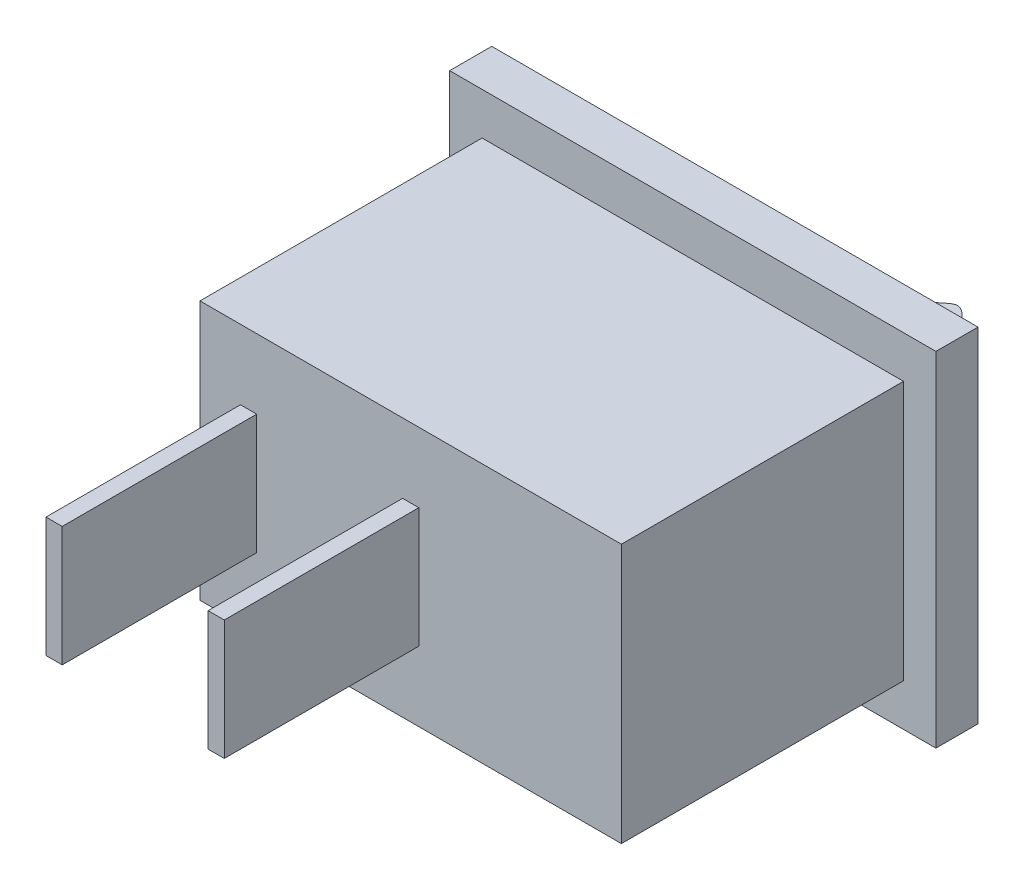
ISO-10303-21;
HEADER;
FILE_DESCRIPTION(('STEP AP214'),'2;1');
FILE_NAME('part.step','',(''),(''),'','','');
FILE_SCHEMA(('AUTOMOTIVE_DESIGN { 1 0 10303 214 1 1 1 1 }'));
ENDSEC;
DATA;
#1=APPLICATION_CONTEXT('core data for automotive mechanical design processes');
#2=APPLICATION_PROTOCOL_DEFINITION('international standard','automotive_design',2000,#1);
#3=PRODUCT_CONTEXT('',#1,'mechanical');
#4=PRODUCT('Part','Part','',(#3));
#5=PRODUCT_RELATED_PRODUCT_CATEGORY('part','',(#4));
#6=PRODUCT_DEFINITION_FORMATION('','',#4);
#7=PRODUCT_DEFINITION_CONTEXT('part definition',#1,'design');
#8=PRODUCT_DEFINITION('design','',#6,#7);
#9=PRODUCT_DEFINITION_SHAPE('','',#8);
#10=(LENGTH_UNIT() NAMED_UNIT(*) SI_UNIT(.MILLI.,.METRE.));
#11=(NAMED_UNIT(*) PLANE_ANGLE_UNIT() SI_UNIT($,.RADIAN.));
#12=(NAMED_UNIT(*) SI_UNIT($,.STERADIAN.) SOLID_ANGLE_UNIT());
#13=UNCERTAINTY_MEASURE_WITH_UNIT(LENGTH_MEASURE(1.E-05),#10,'distance_accuracy_value','');
#14=(GEOMETRIC_REPRESENTATION_CONTEXT(3) GLOBAL_UNCERTAINTY_ASSIGNED_CONTEXT((#13)) GLOBAL_UNIT_ASSIGNED_CONTEXT((#10,
#11,#12)) REPRESENTATION_CONTEXT('',''));
#15=CARTESIAN_POINT('',(0.,0.,0.));
#16=DIRECTION('',(0.,0.,1.));
#17=DIRECTION('',(1.,0.,0.));
#18=AXIS2_PLACEMENT_3D('',#15,#16,#17);
#19=CARTESIAN_POINT('',(-7.5,5.3,-8.));
#20=DIRECTION('',(1.,0.,0.));
#21=DIRECTION('',(0.,0.,-1.));
#22=AXIS2_PLACEMENT_3D('',#19,#20,#21);
#23=PLANE('',#22);
#24=DIRECTION('',(0.,-1.,0.));
#25=VECTOR('',#24,1.);
#26=CARTESIAN_POINT('',(-7.5,-4.,-6.70193985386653));
#27=LINE('',#26,#25);
#28=CARTESIAN_POINT('',(-7.5,5.3,-6.70193985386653));
#29=VERTEX_POINT('',#28);
#30=CARTESIAN_POINT('',(-7.5,-5.3,-6.70193985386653));
#31=VERTEX_POINT('',#30);
#32=EDGE_CURVE('E205',#29,#31,#27,.T.);
#33=ORIENTED_EDGE('',*,*,#32,.F.);
#34=DIRECTION('',(0.,0.,1.));
#35=VECTOR('',#34,1.);
#36=CARTESIAN_POINT('',(-7.5,5.3,-8.));
#37=LINE('',#36,#35);
#38=CARTESIAN_POINT('',(-7.5,5.3,-8.));
#39=VERTEX_POINT('',#38);
#40=EDGE_CURVE('E265',#39,#29,#37,.T.);
#41=ORIENTED_EDGE('',*,*,#40,.F.);
#42=DIRECTION('',(0.,-1.,0.));
#43=VECTOR('',#42,1.);
#44=CARTESIAN_POINT('',(-7.5,5.3,-8.));
#45=LINE('',#44,#43);
#46=CARTESIAN_POINT('',(-7.5,-5.3,-8.));
#47=VERTEX_POINT('',#46);
#48=EDGE_CURVE('E273',#39,#47,#45,.T.);
#49=ORIENTED_EDGE('',*,*,#48,.T.);
#50=DIRECTION('',(0.,0.,1.));
#51=VECTOR('',#50,1.);
#52=CARTESIAN_POINT('',(-7.5,-5.3,-8.));
#53=LINE('',#52,#51);
#54=EDGE_CURVE('E264',#47,#31,#53,.T.);
#55=ORIENTED_EDGE('',*,*,#54,.T.);
#56=EDGE_LOOP('',(#33,#41,#49,#55));
#57=FACE_BOUND('',#56,.T.);
#58=ADVANCED_FACE('F32',(#57),#23,.F.);
#59=CARTESIAN_POINT('',(-5.25,5.3,8.));
#60=DIRECTION('',(1.,0.,0.));
#61=DIRECTION('',(0.,0.,-1.));
#62=AXIS2_PLACEMENT_3D('',#59,#60,#61);
#63=PLANE('',#62);
#64=DIRECTION('',(0.,-1.,0.));
#65=VECTOR('',#64,1.);
#66=CARTESIAN_POINT('',(-5.25,5.3,2.));
#67=LINE('',#66,#65);
#68=CARTESIAN_POINT('',(-5.25,1.85,2.));
#69=VERTEX_POINT('',#68);
#70=CARTESIAN_POINT('',(-5.25,-1.85,2.));
#71=VERTEX_POINT('',#70);
#72=EDGE_CURVE('E305',#69,#71,#67,.T.);
#73=ORIENTED_EDGE('',*,*,#72,.T.);
#74=DIRECTION('',(0.,0.,1.));
#75=VECTOR('',#74,1.);
#76=CARTESIAN_POINT('',(-5.25,-1.85,8.));
#77=LINE('',#76,#75);
#78=CARTESIAN_POINT('',(-5.25,-1.85,8.));
#79=VERTEX_POINT('',#78);
#80=EDGE_CURVE('E261',#71,#79,#77,.T.);
#81=ORIENTED_EDGE('',*,*,#80,.T.);
#82=DIRECTION('',(0.,-1.,0.));
#83=VECTOR('',#82,1.);
#84=CARTESIAN_POINT('',(-5.25,5.3,8.));
#85=LINE('',#84,#83);
#86=CARTESIAN_POINT('',(-5.25,1.85,8.));
#87=VERTEX_POINT('',#86);
#88=EDGE_CURVE('E302',#87,#79,#85,.T.);
#89=ORIENTED_EDGE('',*,*,#88,.F.);
#90=DIRECTION('',(0.,0.,-1.));
#91=VECTOR('',#90,1.);
#92=CARTESIAN_POINT('',(-5.25,1.85,8.));
#93=LINE('',#92,#91);
#94=EDGE_CURVE('E243',#87,#69,#93,.T.);
#95=ORIENTED_EDGE('',*,*,#94,.T.);
#96=EDGE_LOOP('',(#73,#81,#89,#95));
#97=FACE_BOUND('',#96,.T.);
#98=ADVANCED_FACE('F339',(#97),#63,.F.);
#99=CARTESIAN_POINT('',(-5.25,5.3,8.));
#100=DIRECTION('',(0.,0.,-1.));
#101=DIRECTION('',(-1.,0.,0.));
#102=AXIS2_PLACEMENT_3D('',#99,#100,#101);
#103=PLANE('',#102);
#104=ORIENTED_EDGE('',*,*,#88,.T.);
#105=DIRECTION('',(1.,0.,0.));
#106=VECTOR('',#105,1.);
#107=CARTESIAN_POINT('',(-5.25,-1.85,8.));
#108=LINE('',#107,#106);
#109=CARTESIAN_POINT('',(-4.75,-1.85,8.));
#110=VERTEX_POINT('',#109);
#111=EDGE_CURVE('E258',#79,#110,#108,.T.);
#112=ORIENTED_EDGE('',*,*,#111,.T.);
#113=DIRECTION('',(0.,-1.,0.));
#114=VECTOR('',#113,1.);
#115=CARTESIAN_POINT('',(-4.75,5.3,8.));
#116=LINE('',#115,#114);
#117=CARTESIAN_POINT('',(-4.75,1.85,8.));
#118=VERTEX_POINT('',#117);
#119=EDGE_CURVE('E299',#118,#110,#116,.T.);
#120=ORIENTED_EDGE('',*,*,#119,.F.);
#121=DIRECTION('',(-1.,0.,0.));
#122=VECTOR('',#121,1.);
#123=CARTESIAN_POINT('',(-5.25,1.85,8.));
#124=LINE('',#123,#122);
#125=EDGE_CURVE('E240',#118,#87,#124,.T.);
#126=ORIENTED_EDGE('',*,*,#125,.T.);
#127=EDGE_LOOP('',(#104,#112,#120,#126));
#128=FACE_BOUND('',#127,.T.);
#129=ADVANCED_FACE('F343',(#128),#103,.F.);
#130=CARTESIAN_POINT('',(-4.75,5.3,8.));
#131=DIRECTION('',(-1.,0.,0.));
#132=DIRECTION('',(0.,0.,1.));
#133=AXIS2_PLACEMENT_3D('',#130,#131,#132);
#134=PLANE('',#133);
#135=ORIENTED_EDGE('',*,*,#119,.T.);
#136=DIRECTION('',(0.,0.,-1.));
#137=VECTOR('',#136,1.);
#138=CARTESIAN_POINT('',(-4.75,-1.85,8.));
#139=LINE('',#138,#137);
#140=CARTESIAN_POINT('',(-4.75,-1.85,2.));
#141=VERTEX_POINT('',#140);
#142=EDGE_CURVE('E255',#110,#141,#139,.T.);
#143=ORIENTED_EDGE('',*,*,#142,.T.);
#144=DIRECTION('',(0.,-1.,0.));
#145=VECTOR('',#144,1.);
#146=CARTESIAN_POINT('',(-4.75,5.3,2.));
#147=LINE('',#146,#145);
#148=CARTESIAN_POINT('',(-4.75,1.85,2.));
#149=VERTEX_POINT('',#148);
#150=EDGE_CURVE('E296',#149,#141,#147,.T.);
#151=ORIENTED_EDGE('',*,*,#150,.F.);
#152=DIRECTION('',(0.,0.,1.));
#153=VECTOR('',#152,1.);
#154=CARTESIAN_POINT('',(-4.75,1.85,8.));
#155=LINE('',#154,#153);
#156=EDGE_CURVE('E237',#149,#118,#155,.T.);
#157=ORIENTED_EDGE('',*,*,#156,.T.);
#158=EDGE_LOOP('',(#135,#143,#151,#157));
#159=FACE_BOUND('',#158,.T.);
#160=ADVANCED_FACE('F348',(#159),#134,.F.);
#161=CARTESIAN_POINT('',(-0.25,5.3,8.));
#162=DIRECTION('',(1.,0.,0.));
#163=DIRECTION('',(0.,0.,-1.));
#164=AXIS2_PLACEMENT_3D('',#161,#162,#163);
#165=PLANE('',#164);
#166=DIRECTION('',(0.,-1.,0.));
#167=VECTOR('',#166,1.);
#168=CARTESIAN_POINT('',(-0.25,5.3,2.));
#169=LINE('',#168,#167);
#170=CARTESIAN_POINT('',(-0.25,1.85,2.));
#171=VERTEX_POINT('',#170);
#172=CARTESIAN_POINT('',(-0.25,-1.85,2.));
#173=VERTEX_POINT('',#172);
#174=EDGE_CURVE('E293',#171,#173,#169,.T.);
#175=ORIENTED_EDGE('',*,*,#174,.T.);
#176=DIRECTION('',(0.,0.,1.));
#177=VECTOR('',#176,1.);
#178=CARTESIAN_POINT('',(-0.25,-1.85,8.));
#179=LINE('',#178,#177);
#180=CARTESIAN_POINT('',(-0.25,-1.85,8.));
#181=VERTEX_POINT('',#180);
#182=EDGE_CURVE('E252',#173,#181,#179,.T.);
#183=ORIENTED_EDGE('',*,*,#182,.T.);
#184=DIRECTION('',(0.,-1.,0.));
#185=VECTOR('',#184,1.);
#186=CARTESIAN_POINT('',(-0.25,5.3,8.));
#187=LINE('',#186,#185);
#188=CARTESIAN_POINT('',(-0.25,1.85,8.));
#189=VERTEX_POINT('',#188);
#190=EDGE_CURVE('E290',#189,#181,#187,.T.);
#191=ORIENTED_EDGE('',*,*,#190,.F.);
#192=DIRECTION('',(0.,0.,-1.));
#193=VECTOR('',#192,1.);
#194=CARTESIAN_POINT('',(-0.25,1.85,8.));
#195=LINE('',#194,#193);
#196=EDGE_CURVE('E234',#189,#171,#195,.T.);
#197=ORIENTED_EDGE('',*,*,#196,.T.);
#198=EDGE_LOOP('',(#175,#183,#191,#197));
#199=FACE_BOUND('',#198,.T.);
#200=ADVANCED_FACE('F354',(#199),#165,.F.);
#201=CARTESIAN_POINT('',(-0.25,5.3,8.));
#202=DIRECTION('',(0.,0.,-1.));
#203=DIRECTION('',(-1.,0.,0.));
#204=AXIS2_PLACEMENT_3D('',#201,#202,#203);
#205=PLANE('',#204);
#206=ORIENTED_EDGE('',*,*,#190,.T.);
#207=DIRECTION('',(1.,0.,0.));
#208=VECTOR('',#207,1.);
#209=CARTESIAN_POINT('',(-0.25,-1.85,8.));
#210=LINE('',#209,#208);
#211=CARTESIAN_POINT('',(0.25,-1.85,8.));
#212=VERTEX_POINT('',#211);
#213=EDGE_CURVE('E249',#181,#212,#210,.T.);
#214=ORIENTED_EDGE('',*,*,#213,.T.);
#215=DIRECTION('',(0.,-1.,0.));
#216=VECTOR('',#215,1.);
#217=CARTESIAN_POINT('',(0.25,5.3,8.));
#218=LINE('',#217,#216);
#219=CARTESIAN_POINT('',(0.25,1.85,8.));
#220=VERTEX_POINT('',#219);
#221=EDGE_CURVE('E287',#220,#212,#218,.T.);
#222=ORIENTED_EDGE('',*,*,#221,.F.);
#223=DIRECTION('',(-1.,0.,0.));
#224=VECTOR('',#223,1.);
#225=CARTESIAN_POINT('',(-0.25,1.85,8.));
#226=LINE('',#225,#224);
#227=EDGE_CURVE('E231',#220,#189,#226,.T.);
#228=ORIENTED_EDGE('',*,*,#227,.T.);
#229=EDGE_LOOP('',(#206,#214,#222,#228));
#230=FACE_BOUND('',#229,.T.);
#231=ADVANCED_FACE('F358',(#230),#205,.F.);
#232=CARTESIAN_POINT('',(0.25,5.3,8.));
#233=DIRECTION('',(-1.,0.,0.));
#234=DIRECTION('',(0.,0.,1.));
#235=AXIS2_PLACEMENT_3D('',#232,#233,#234);
#236=PLANE('',#235);
#237=ORIENTED_EDGE('',*,*,#221,.T.);
#238=DIRECTION('',(0.,0.,-1.));
#239=VECTOR('',#238,1.);
#240=CARTESIAN_POINT('',(0.25,-1.85,8.));
#241=LINE('',#240,#239);
#242=CARTESIAN_POINT('',(0.25,-1.85,2.));
#243=VERTEX_POINT('',#242);
#244=EDGE_CURVE('E246',#212,#243,#241,.T.);
#245=ORIENTED_EDGE('',*,*,#244,.T.);
#246=DIRECTION('',(0.,-1.,0.));
#247=VECTOR('',#246,1.);
#248=CARTESIAN_POINT('',(0.25,5.3,2.));
#249=LINE('',#248,#247);
#250=CARTESIAN_POINT('',(0.25,1.85,2.));
#251=VERTEX_POINT('',#250);
#252=EDGE_CURVE('E284',#251,#243,#249,.T.);
#253=ORIENTED_EDGE('',*,*,#252,.F.);
#254=DIRECTION('',(0.,0.,1.));
#255=VECTOR('',#254,1.);
#256=CARTESIAN_POINT('',(0.25,1.85,8.));
#257=LINE('',#256,#255);
#258=EDGE_CURVE('E228',#251,#220,#257,.T.);
#259=ORIENTED_EDGE('',*,*,#258,.T.);
#260=EDGE_LOOP('',(#237,#245,#253,#259));
#261=FACE_BOUND('',#260,.T.);
#262=ADVANCED_FACE('F362',(#261),#236,.F.);
#263=CARTESIAN_POINT('',(0.25,5.3,2.));
#264=DIRECTION('',(0.,0.,-1.));
#265=DIRECTION('',(-1.,0.,0.));
#266=AXIS2_PLACEMENT_3D('',#263,#264,#265);
#267=PLANE('',#266);
#268=DIRECTION('',(-1.,0.,0.));
#269=VECTOR('',#268,1.);
#270=CARTESIAN_POINT('',(3.1,-1.85,2.));
#271=LINE('',#270,#269);
#272=EDGE_CURVE('E222',#141,#71,#271,.T.);
#273=ORIENTED_EDGE('',*,*,#272,.T.);
#274=ORIENTED_EDGE('',*,*,#72,.F.);
#275=DIRECTION('',(-1.,0.,0.));
#276=VECTOR('',#275,1.);
#277=CARTESIAN_POINT('',(3.1,1.85,2.));
#278=LINE('',#277,#276);
#279=EDGE_CURVE('E221',#149,#69,#278,.T.);
#280=ORIENTED_EDGE('',*,*,#279,.F.);
#281=ORIENTED_EDGE('',*,*,#150,.T.);
#282=EDGE_LOOP('',(#273,#274,#280,#281));
#283=FACE_BOUND('',#282,.T.);
#284=EDGE_CURVE('E225',#243,#173,#271,.T.);
#285=ORIENTED_EDGE('',*,*,#284,.T.);
#286=ORIENTED_EDGE('',*,*,#174,.F.);
#287=EDGE_CURVE('E226',#251,#171,#278,.T.);
#288=ORIENTED_EDGE('',*,*,#287,.F.);
#289=ORIENTED_EDGE('',*,*,#252,.T.);
#290=EDGE_LOOP('',(#285,#286,#288,#289));
#291=FACE_BOUND('',#290,.T.);
#292=DIRECTION('',(1.,0.,0.));
#293=VECTOR('',#292,1.);
#294=CARTESIAN_POINT('',(0.25,-4.,2.));
#295=LINE('',#294,#293);
#296=CARTESIAN_POINT('',(-6.5,-4.,2.));
#297=VERTEX_POINT('',#296);
#298=CARTESIAN_POINT('',(6.5,-4.,2.));
#299=VERTEX_POINT('',#298);
#300=EDGE_CURVE('E218',#297,#299,#295,.T.);
#301=ORIENTED_EDGE('',*,*,#300,.T.);
#302=DIRECTION('',(0.,1.,0.));
#303=VECTOR('',#302,1.);
#304=CARTESIAN_POINT('',(6.5,5.3,2.));
#305=LINE('',#304,#303);
#306=CARTESIAN_POINT('',(6.5,4.,2.));
#307=VERTEX_POINT('',#306);
#308=EDGE_CURVE('E201',#299,#307,#305,.T.);
#309=ORIENTED_EDGE('',*,*,#308,.T.);
#310=DIRECTION('',(-1.,0.,0.));
#311=VECTOR('',#310,1.);
#312=CARTESIAN_POINT('',(0.25,4.,2.));
#313=LINE('',#312,#311);
#314=CARTESIAN_POINT('',(-6.5,4.,2.));
#315=VERTEX_POINT('',#314);
#316=EDGE_CURVE('E215',#307,#315,#313,.T.);
#317=ORIENTED_EDGE('',*,*,#316,.T.);
#318=DIRECTION('',(0.,-1.,0.));
#319=VECTOR('',#318,1.);
#320=CARTESIAN_POINT('',(-6.5,5.3,2.));
#321=LINE('',#320,#319);
#322=EDGE_CURVE('E195',#315,#297,#321,.T.);
#323=ORIENTED_EDGE('',*,*,#322,.T.);
#324=EDGE_LOOP('',(#301,#309,#317,#323));
#325=FACE_BOUND('',#324,.T.);
#326=ADVANCED_FACE('F366',(#283,#291,#325),#267,.F.);
#327=CARTESIAN_POINT('',(7.5,5.3,-8.));
#328=DIRECTION('',(-1.,0.,0.));
#329=DIRECTION('',(0.,0.,1.));
#330=AXIS2_PLACEMENT_3D('',#327,#328,#329);
#331=PLANE('',#330);
#332=DIRECTION('',(0.,0.,-1.));
#333=VECTOR('',#332,1.);
#334=CARTESIAN_POINT('',(7.5,5.3,-8.));
#335=LINE('',#334,#333);
#336=CARTESIAN_POINT('',(7.5,5.3,-6.70193985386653));
#337=VERTEX_POINT('',#336);
#338=CARTESIAN_POINT('',(7.5,5.3,-8.));
#339=VERTEX_POINT('',#338);
#340=EDGE_CURVE('E268',#337,#339,#335,.T.);
#341=ORIENTED_EDGE('',*,*,#340,.F.);
#342=DIRECTION('',(0.,-1.,0.));
#343=VECTOR('',#342,1.);
#344=CARTESIAN_POINT('',(7.5,5.3,-6.70193985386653));
#345=LINE('',#344,#343);
#346=CARTESIAN_POINT('',(7.5,-5.3,-6.70193985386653));
#347=VERTEX_POINT('',#346);
#348=EDGE_CURVE('E210',#337,#347,#345,.T.);
#349=ORIENTED_EDGE('',*,*,#348,.T.);
#350=DIRECTION('',(0.,0.,-1.));
#351=VECTOR('',#350,1.);
#352=CARTESIAN_POINT('',(7.5,-5.3,-8.));
#353=LINE('',#352,#351);
#354=CARTESIAN_POINT('',(7.5,-5.3,-8.));
#355=VERTEX_POINT('',#354);
#356=EDGE_CURVE('E276',#347,#355,#353,.T.);
#357=ORIENTED_EDGE('',*,*,#356,.T.);
#358=DIRECTION('',(0.,-1.,0.));
#359=VECTOR('',#358,1.);
#360=CARTESIAN_POINT('',(7.5,5.3,-8.));
#361=LINE('',#360,#359);
#362=EDGE_CURVE('E281',#339,#355,#361,.T.);
#363=ORIENTED_EDGE('',*,*,#362,.F.);
#364=EDGE_LOOP('',(#341,#349,#357,#363));
#365=FACE_BOUND('',#364,.T.);
#366=ADVANCED_FACE('F323',(#365),#331,.F.);
#367=CARTESIAN_POINT('',(-7.5,5.3,-8.));
#368=DIRECTION('',(0.,0.,1.));
#369=DIRECTION('',(1.,0.,0.));
#370=AXIS2_PLACEMENT_3D('',#367,#368,#369);
#371=PLANE('',#370);
#372=DIRECTION('',(0.,-1.,0.));
#373=VECTOR('',#372,1.);
#374=CARTESIAN_POINT('',(5.02015952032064,2.5,-8.));
#375=LINE('',#374,#373);
#376=CARTESIAN_POINT('',(5.02015952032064,2.5,-8.));
#377=VERTEX_POINT('',#376);
#378=CARTESIAN_POINT('',(5.02015952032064,-2.5,-8.));
#379=VERTEX_POINT('',#378);
#380=EDGE_CURVE('E46',#377,#379,#375,.T.);
#381=ORIENTED_EDGE('',*,*,#380,.F.);
#382=DIRECTION('',(1.,0.,0.));
#383=VECTOR('',#382,1.);
#384=CARTESIAN_POINT('',(-4.43069672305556,2.5,-8.));
#385=LINE('',#384,#383);
#386=CARTESIAN_POINT('',(-4.43069672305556,2.5,-8.));
#387=VERTEX_POINT('',#386);
#388=EDGE_CURVE('E50',#387,#377,#385,.T.);
#389=ORIENTED_EDGE('',*,*,#388,.F.);
#390=DIRECTION('',(0.,-1.,0.));
#391=VECTOR('',#390,1.);
#392=CARTESIAN_POINT('',(-4.43069672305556,2.5,-8.));
#393=LINE('',#392,#391);
#394=CARTESIAN_POINT('',(-4.43069672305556,-2.5,-8.));
#395=VERTEX_POINT('',#394);
#396=EDGE_CURVE('E167',#387,#395,#393,.T.);
#397=ORIENTED_EDGE('',*,*,#396,.T.);
#398=DIRECTION('',(1.,0.,0.));
#399=VECTOR('',#398,1.);
#400=CARTESIAN_POINT('',(-4.43069672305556,-2.5,-8.));
#401=LINE('',#400,#399);
#402=EDGE_CURVE('E174',#395,#379,#401,.T.);
#403=ORIENTED_EDGE('',*,*,#402,.T.);
#404=EDGE_LOOP('',(#381,#389,#397,#403));
#405=FACE_BOUND('',#404,.T.);
#406=DIRECTION('',(-1.,0.,0.));
#407=VECTOR('',#406,1.);
#408=CARTESIAN_POINT('',(-7.5,-5.3,-8.));
#409=LINE('',#408,#407);
#410=EDGE_CURVE('E269',#355,#47,#409,.T.);
#411=ORIENTED_EDGE('',*,*,#410,.T.);
#412=ORIENTED_EDGE('',*,*,#48,.F.);
#413=DIRECTION('',(-1.,0.,0.));
#414=VECTOR('',#413,1.);
#415=CARTESIAN_POINT('',(-7.5,5.3,-8.));
#416=LINE('',#415,#414);
#417=EDGE_CURVE('E271',#339,#39,#416,.T.);
#418=ORIENTED_EDGE('',*,*,#417,.F.);
#419=ORIENTED_EDGE('',*,*,#362,.T.);
#420=EDGE_LOOP('',(#411,#412,#418,#419));
#421=FACE_BOUND('',#420,.T.);
#422=ADVANCED_FACE('F319',(#405,#421),#371,.F.);
#423=CARTESIAN_POINT('',(0.,5.3,0.));
#424=DIRECTION('',(0.,1.,0.));
#425=DIRECTION('',(0.,0.,1.));
#426=AXIS2_PLACEMENT_3D('',#423,#424,#425);
#427=PLANE('',#426);
#428=DIRECTION('',(-1.,0.,0.));
#429=VECTOR('',#428,1.);
#430=CARTESIAN_POINT('',(0.,5.3,-6.70193985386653));
#431=LINE('',#430,#429);
#432=EDGE_CURVE('E11',#337,#29,#431,.T.);
#433=ORIENTED_EDGE('',*,*,#432,.F.);
#434=ORIENTED_EDGE('',*,*,#340,.T.);
#435=ORIENTED_EDGE('',*,*,#417,.T.);
#436=ORIENTED_EDGE('',*,*,#40,.T.);
#437=EDGE_LOOP('',(#433,#434,#435,#436));
#438=FACE_BOUND('',#437,.T.);
#439=ADVANCED_FACE('F327',(#438),#427,.T.);
#440=CARTESIAN_POINT('',(0.,-5.3,0.));
#441=DIRECTION('',(0.,1.,0.));
#442=DIRECTION('',(0.,0.,1.));
#443=AXIS2_PLACEMENT_3D('',#440,#441,#442);
#444=PLANE('',#443);
#445=ORIENTED_EDGE('',*,*,#356,.F.);
#446=DIRECTION('',(-1.,0.,0.));
#447=VECTOR('',#446,1.);
#448=CARTESIAN_POINT('',(0.,-5.3,-6.70193985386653));
#449=LINE('',#448,#447);
#450=EDGE_CURVE('E39',#347,#31,#449,.T.);
#451=ORIENTED_EDGE('',*,*,#450,.T.);
#452=ORIENTED_EDGE('',*,*,#54,.F.);
#453=ORIENTED_EDGE('',*,*,#410,.F.);
#454=EDGE_LOOP('',(#445,#451,#452,#453));
#455=FACE_BOUND('',#454,.T.);
#456=ADVANCED_FACE('F311',(#455),#444,.F.);
#457=CARTESIAN_POINT('',(3.1,-1.85,2.));
#458=DIRECTION('',(0.,1.,0.));
#459=DIRECTION('',(0.,0.,1.));
#460=AXIS2_PLACEMENT_3D('',#457,#458,#459);
#461=PLANE('',#460);
#462=ORIENTED_EDGE('',*,*,#272,.F.);
#463=ORIENTED_EDGE('',*,*,#142,.F.);
#464=ORIENTED_EDGE('',*,*,#111,.F.);
#465=ORIENTED_EDGE('',*,*,#80,.F.);
#466=EDGE_LOOP('',(#462,#463,#464,#465));
#467=FACE_BOUND('',#466,.T.);
#468=ADVANCED_FACE('F334',(#467),#461,.F.);
#469=ORIENTED_EDGE('',*,*,#284,.F.);
#470=ORIENTED_EDGE('',*,*,#244,.F.);
#471=ORIENTED_EDGE('',*,*,#213,.F.);
#472=ORIENTED_EDGE('',*,*,#182,.F.);
#473=EDGE_LOOP('',(#469,#470,#471,#472));
#474=FACE_BOUND('',#473,.T.);
#475=ADVANCED_FACE('F462',(#474),#461,.F.);
#476=CARTESIAN_POINT('',(3.1,1.85,2.));
#477=DIRECTION('',(0.,-1.,0.));
#478=DIRECTION('',(0.,0.,-1.));
#479=AXIS2_PLACEMENT_3D('',#476,#477,#478);
#480=PLANE('',#479);
#481=ORIENTED_EDGE('',*,*,#125,.F.);
#482=ORIENTED_EDGE('',*,*,#156,.F.);
#483=ORIENTED_EDGE('',*,*,#279,.T.);
#484=ORIENTED_EDGE('',*,*,#94,.F.);
#485=EDGE_LOOP('',(#481,#482,#483,#484));
#486=FACE_BOUND('',#485,.T.);
#487=ADVANCED_FACE('F464',(#486),#480,.F.);
#488=ORIENTED_EDGE('',*,*,#227,.F.);
#489=ORIENTED_EDGE('',*,*,#258,.F.);
#490=ORIENTED_EDGE('',*,*,#287,.T.);
#491=ORIENTED_EDGE('',*,*,#196,.F.);
#492=EDGE_LOOP('',(#488,#489,#490,#491));
#493=FACE_BOUND('',#492,.T.);
#494=ADVANCED_FACE('F456',(#493),#480,.F.);
#495=CARTESIAN_POINT('',(13.1,-4.,-6.70193985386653));
#496=DIRECTION('',(0.,1.,0.));
#497=DIRECTION('',(0.,0.,1.));
#498=AXIS2_PLACEMENT_3D('',#495,#496,#497);
#499=PLANE('',#498);
#500=DIRECTION('',(-1.,0.,0.));
#501=VECTOR('',#500,1.);
#502=CARTESIAN_POINT('',(13.1,-4.,-6.70193985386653));
#503=LINE('',#502,#501);
#504=CARTESIAN_POINT('',(6.5,-4.,-6.70193985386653));
#505=VERTEX_POINT('',#504);
#506=CARTESIAN_POINT('',(-6.5,-4.,-6.70193985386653));
#507=VERTEX_POINT('',#506);
#508=EDGE_CURVE('E207',#505,#507,#503,.T.);
#509=ORIENTED_EDGE('',*,*,#508,.F.);
#510=DIRECTION('',(0.,0.,-1.));
#511=VECTOR('',#510,1.);
#512=CARTESIAN_POINT('',(6.5,-4.,-6.70193985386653));
#513=LINE('',#512,#511);
#514=EDGE_CURVE('E186',#299,#505,#513,.T.);
#515=ORIENTED_EDGE('',*,*,#514,.F.);
#516=ORIENTED_EDGE('',*,*,#300,.F.);
#517=DIRECTION('',(0.,0.,1.));
#518=VECTOR('',#517,1.);
#519=CARTESIAN_POINT('',(-6.5,-4.,-6.70193985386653));
#520=LINE('',#519,#518);
#521=EDGE_CURVE('E179',#507,#297,#520,.T.);
#522=ORIENTED_EDGE('',*,*,#521,.F.);
#523=EDGE_LOOP('',(#509,#515,#516,#522));
#524=FACE_BOUND('',#523,.T.);
#525=ADVANCED_FACE('F452',(#524),#499,.F.);
#526=CARTESIAN_POINT('',(13.1,-4.,-6.70193985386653));
#527=DIRECTION('',(0.,0.,-1.));
#528=DIRECTION('',(-1.,0.,0.));
#529=AXIS2_PLACEMENT_3D('',#526,#527,#528);
#530=PLANE('',#529);
#531=DIRECTION('',(0.,-1.,0.));
#532=VECTOR('',#531,1.);
#533=CARTESIAN_POINT('',(6.5,16.6,-6.70193985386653));
#534=LINE('',#533,#532);
#535=CARTESIAN_POINT('',(6.5,4.,-6.70193985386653));
#536=VERTEX_POINT('',#535);
#537=EDGE_CURVE('E189',#536,#505,#534,.T.);
#538=ORIENTED_EDGE('',*,*,#537,.T.);
#539=ORIENTED_EDGE('',*,*,#508,.T.);
#540=DIRECTION('',(0.,-1.,0.));
#541=VECTOR('',#540,1.);
#542=CARTESIAN_POINT('',(-6.5,16.6,-6.70193985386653));
#543=LINE('',#542,#541);
#544=CARTESIAN_POINT('',(-6.49999999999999,4.,-6.70193985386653));
#545=VERTEX_POINT('',#544);
#546=EDGE_CURVE('E181',#545,#507,#543,.T.);
#547=ORIENTED_EDGE('',*,*,#546,.F.);
#548=DIRECTION('',(-1.,0.,0.));
#549=VECTOR('',#548,1.);
#550=CARTESIAN_POINT('',(13.1,4.,-6.70193985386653));
#551=LINE('',#550,#549);
#552=EDGE_CURVE('E204',#536,#545,#551,.T.);
#553=ORIENTED_EDGE('',*,*,#552,.F.);
#554=EDGE_LOOP('',(#538,#539,#547,#553));
#555=FACE_BOUND('',#554,.T.);
#556=ORIENTED_EDGE('',*,*,#348,.F.);
#557=ORIENTED_EDGE('',*,*,#432,.T.);
#558=ORIENTED_EDGE('',*,*,#32,.T.);
#559=ORIENTED_EDGE('',*,*,#450,.F.);
#560=EDGE_LOOP('',(#556,#557,#558,#559));
#561=FACE_BOUND('',#560,.T.);
#562=ADVANCED_FACE('F325',(#555,#561),#530,.F.);
#563=CARTESIAN_POINT('',(13.1,4.,-6.70193985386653));
#564=DIRECTION('',(0.,-1.,0.));
#565=DIRECTION('',(0.,0.,-1.));
#566=AXIS2_PLACEMENT_3D('',#563,#564,#565);
#567=PLANE('',#566);
#568=ORIENTED_EDGE('',*,*,#316,.F.);
#569=DIRECTION('',(0.,0.,-1.));
#570=VECTOR('',#569,1.);
#571=CARTESIAN_POINT('',(6.5,4.,-6.70193985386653));
#572=LINE('',#571,#570);
#573=EDGE_CURVE('E198',#307,#536,#572,.T.);
#574=ORIENTED_EDGE('',*,*,#573,.T.);
#575=ORIENTED_EDGE('',*,*,#552,.T.);
#576=DIRECTION('',(0.,0.,1.));
#577=VECTOR('',#576,1.);
#578=CARTESIAN_POINT('',(-6.5,4.,-6.70193985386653));
#579=LINE('',#578,#577);
#580=EDGE_CURVE('E190',#545,#315,#579,.T.);
#581=ORIENTED_EDGE('',*,*,#580,.T.);
#582=EDGE_LOOP('',(#568,#574,#575,#581));
#583=FACE_BOUND('',#582,.T.);
#584=ADVANCED_FACE('F448',(#583),#567,.F.);
#585=CARTESIAN_POINT('',(-6.5,16.6,-6.70193985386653));
#586=DIRECTION('',(1.,0.,0.));
#587=DIRECTION('',(0.,0.,-1.));
#588=AXIS2_PLACEMENT_3D('',#585,#586,#587);
#589=PLANE('',#588);
#590=ORIENTED_EDGE('',*,*,#580,.F.);
#591=ORIENTED_EDGE('',*,*,#546,.T.);
#592=ORIENTED_EDGE('',*,*,#521,.T.);
#593=ORIENTED_EDGE('',*,*,#322,.F.);
#594=EDGE_LOOP('',(#590,#591,#592,#593));
#595=FACE_BOUND('',#594,.T.);
#596=ADVANCED_FACE('F444',(#595),#589,.F.);
#597=CARTESIAN_POINT('',(6.5,16.6,-6.70193985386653));
#598=DIRECTION('',(-1.,0.,0.));
#599=DIRECTION('',(0.,0.,1.));
#600=AXIS2_PLACEMENT_3D('',#597,#598,#599);
#601=PLANE('',#600);
#602=ORIENTED_EDGE('',*,*,#514,.T.);
#603=ORIENTED_EDGE('',*,*,#537,.F.);
#604=ORIENTED_EDGE('',*,*,#573,.F.);
#605=ORIENTED_EDGE('',*,*,#308,.F.);
#606=EDGE_LOOP('',(#602,#603,#604,#605));
#607=FACE_BOUND('',#606,.T.);
#608=ADVANCED_FACE('F387',(#607),#601,.F.);
#609=CARTESIAN_POINT('',(5.02015952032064,2.5,-8.));
#610=CARTESIAN_POINT('',(4.93621526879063,2.5,-8.93053365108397));
#611=CARTESIAN_POINT('',(4.99298304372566,2.5,-9.8907490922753));
#612=CARTESIAN_POINT('',(3.92177124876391,2.5,-11.163629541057));
#613=CARTESIAN_POINT('',(3.66082364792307,2.5,-11.0228402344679));
#614=CARTESIAN_POINT('',(3.51678433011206,2.5,-10.9014937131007));
#615=B_SPLINE_CURVE_WITH_KNOTS('',3,(#609,#610,#611,#612,#613,#614),.UNSPECIFIED.,.F.,.F.,(4,1,
1,4),(0.,0.68802199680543,0.909471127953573,1.),.UNSPECIFIED.);
#616=DIRECTION('',(0.,-1.,0.));
#617=VECTOR('',#616,1.);
#618=SURFACE_OF_LINEAR_EXTRUSION('',#615,#617);
#619=CARTESIAN_POINT('',(5.02015952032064,-2.5,-8.));
#620=CARTESIAN_POINT('',(4.93621526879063,-2.5,-8.93053365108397));
#621=CARTESIAN_POINT('',(4.99298304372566,-2.5,-9.8907490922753));
#622=CARTESIAN_POINT('',(3.92177124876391,-2.5,-11.163629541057));
#623=CARTESIAN_POINT('',(3.66082364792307,-2.5,-11.0228402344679));
#624=CARTESIAN_POINT('',(3.51678433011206,-2.5,-10.9014937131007));
#625=B_SPLINE_CURVE_WITH_KNOTS('',3,(#619,#620,#621,#622,#623,#624),.UNSPECIFIED.,.F.,.F.,(4,1,
1,4),(0.,0.68802199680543,0.909471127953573,1.),.UNSPECIFIED.);
#626=CARTESIAN_POINT('',(3.51678433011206,-2.5,-10.9014937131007));
#627=VERTEX_POINT('',#626);
#628=EDGE_CURVE('E178',#379,#627,#625,.T.);
#629=ORIENTED_EDGE('',*,*,#628,.T.);
#630=DIRECTION('',(0.,-1.,0.));
#631=VECTOR('',#630,1.);
#632=CARTESIAN_POINT('',(3.51678433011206,2.5,-10.9014937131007));
#633=LINE('',#632,#631);
#634=CARTESIAN_POINT('',(3.51678433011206,2.5,-10.9014937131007));
#635=VERTEX_POINT('',#634);
#636=EDGE_CURVE('E165',#635,#627,#633,.T.);
#637=ORIENTED_EDGE('',*,*,#636,.F.);
#638=EDGE_CURVE('E169',#377,#635,#615,.T.);
#639=ORIENTED_EDGE('',*,*,#638,.F.);
#640=ORIENTED_EDGE('',*,*,#380,.T.);
#641=EDGE_LOOP('',(#629,#637,#639,#640));
#642=FACE_BOUND('',#641,.T.);
#643=ADVANCED_FACE('F176',(#642),#618,.F.);
#644=CARTESIAN_POINT('',(-4.43069672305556,2.5,-20.3352190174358));
#645=DIRECTION('',(0.,-1.,0.));
#646=DIRECTION('',(0.,0.,-1.));
#647=AXIS2_PLACEMENT_3D('',#644,#645,#646);
#648=CYLINDRICAL_SURFACE('',#647,12.3352190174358);
#649=CARTESIAN_POINT('',(-4.43069672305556,-2.5,-20.3352190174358));
#650=DIRECTION('',(0.,-1.,0.));
#651=DIRECTION('',(0.,0.,1.));
#652=AXIS2_PLACEMENT_3D('',#649,#650,#651);
#653=CIRCLE('',#652,12.3352190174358);
#654=EDGE_CURVE('E438',#627,#395,#653,.T.);
#655=ORIENTED_EDGE('',*,*,#654,.T.);
#656=ORIENTED_EDGE('',*,*,#396,.F.);
#657=CARTESIAN_POINT('',(-4.43069672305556,2.5,-20.3352190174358));
#658=DIRECTION('',(0.,-1.,0.));
#659=DIRECTION('',(0.,0.,1.));
#660=AXIS2_PLACEMENT_3D('',#657,#658,#659);
#661=CIRCLE('',#660,12.3352190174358);
#662=EDGE_CURVE('E160',#635,#387,#661,.T.);
#663=ORIENTED_EDGE('',*,*,#662,.F.);
#664=ORIENTED_EDGE('',*,*,#636,.T.);
#665=EDGE_LOOP('',(#655,#656,#663,#664));
#666=FACE_BOUND('',#665,.T.);
#667=ADVANCED_FACE('F163',(#666),#648,.F.);
#668=CARTESIAN_POINT('',(4.76302802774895,2.5,-9.82701630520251));
#669=DIRECTION('',(0.,1.,0.));
#670=DIRECTION('',(0.,0.,1.));
#671=AXIS2_PLACEMENT_3D('',#668,#669,#670);
#672=PLANE('',#671);
#673=ORIENTED_EDGE('',*,*,#638,.T.);
#674=ORIENTED_EDGE('',*,*,#662,.T.);
#675=ORIENTED_EDGE('',*,*,#388,.T.);
#676=EDGE_LOOP('',(#673,#674,#675));
#677=FACE_BOUND('',#676,.T.);
#678=ADVANCED_FACE('F172',(#677),#672,.T.);
#679=CARTESIAN_POINT('',(4.76302802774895,-2.5,-9.82701630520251));
#680=DIRECTION('',(0.,1.,0.));
#681=DIRECTION('',(0.,0.,1.));
#682=AXIS2_PLACEMENT_3D('',#679,#680,#681);
#683=PLANE('',#682);
#684=ORIENTED_EDGE('',*,*,#628,.F.);
#685=ORIENTED_EDGE('',*,*,#402,.F.);
#686=ORIENTED_EDGE('',*,*,#654,.F.);
#687=EDGE_LOOP('',(#684,#685,#686));
#688=FACE_BOUND('',#687,.T.);
#689=ADVANCED_FACE('F412',(#688),#683,.F.);
#690=CLOSED_SHELL('',(#58,#98,#129,#160,#200,#231,#262,#326,#366,#422,#439,#456,#468,#475,#487,
#494,#525,#562,#584,#596,#608,#643,#667,#678,#689));
#691=MANIFOLD_SOLID_BREP('B2',#690);
#692=ADVANCED_BREP_SHAPE_REPRESENTATION('',(#18,#691),#14);
#693=SHAPE_DEFINITION_REPRESENTATION(#9,#692);
ENDSEC;
END-ISO-10303-21;
